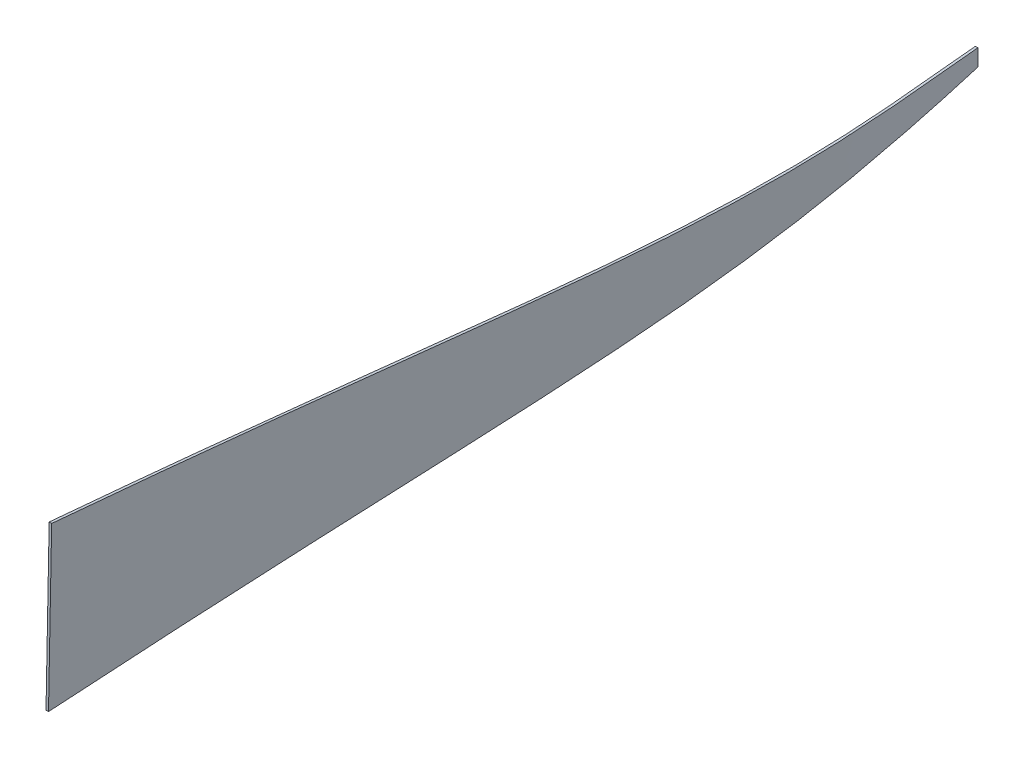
ISO-10303-21;
HEADER;
FILE_DESCRIPTION(('STEP AP214'),'2;1');
FILE_NAME('part.step','',(''),(''),'','','');
FILE_SCHEMA(('AUTOMOTIVE_DESIGN { 1 0 10303 214 1 1 1 1 }'));
ENDSEC;
DATA;
#1=APPLICATION_CONTEXT('core data for automotive mechanical design processes');
#2=APPLICATION_PROTOCOL_DEFINITION('international standard','automotive_design',2000,#1);
#3=PRODUCT_CONTEXT('',#1,'mechanical');
#4=PRODUCT('Part','Part','',(#3));
#5=PRODUCT_RELATED_PRODUCT_CATEGORY('part','',(#4));
#6=PRODUCT_DEFINITION_FORMATION('','',#4);
#7=PRODUCT_DEFINITION_CONTEXT('part definition',#1,'design');
#8=PRODUCT_DEFINITION('design','',#6,#7);
#9=PRODUCT_DEFINITION_SHAPE('','',#8);
#10=(LENGTH_UNIT() NAMED_UNIT(*) SI_UNIT(.MILLI.,.METRE.));
#11=(NAMED_UNIT(*) PLANE_ANGLE_UNIT() SI_UNIT($,.RADIAN.));
#12=(NAMED_UNIT(*) SI_UNIT($,.STERADIAN.) SOLID_ANGLE_UNIT());
#13=UNCERTAINTY_MEASURE_WITH_UNIT(LENGTH_MEASURE(1.E-05),#10,'distance_accuracy_value','');
#14=(GEOMETRIC_REPRESENTATION_CONTEXT(3) GLOBAL_UNCERTAINTY_ASSIGNED_CONTEXT((#13)) GLOBAL_UNIT_ASSIGNED_CONTEXT((#10,
#11,#12)) REPRESENTATION_CONTEXT('',''));
#15=CARTESIAN_POINT('',(0.,0.,0.));
#16=DIRECTION('',(0.,0.,1.));
#17=DIRECTION('',(1.,0.,0.));
#18=AXIS2_PLACEMENT_3D('',#15,#16,#17);
#19=CARTESIAN_POINT('',(76.7293236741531,18.2593360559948,-413.034724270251));
#20=CARTESIAN_POINT('',(77.1879954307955,17.6541807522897,-409.03673791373));
#21=CARTESIAN_POINT('',(77.6301911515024,17.0634474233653,-405.037190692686));
#22=CARTESIAN_POINT('',(78.4768181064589,15.9197203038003,-397.034417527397));
#23=CARTESIAN_POINT('',(78.8812297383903,15.3665096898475,-393.031223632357));
#24=CARTESIAN_POINT('',(79.6472051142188,14.3019232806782,-385.021383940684));
#25=CARTESIAN_POINT('',(80.0087678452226,13.7905062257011,-381.014745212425));
#26=CARTESIAN_POINT('',(80.515186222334,13.0572565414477,-375.002481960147));
#27=CARTESIAN_POINT('',(80.6780047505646,12.8184810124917,-372.998010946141));
#28=CARTESIAN_POINT('',(80.9910351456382,12.3525963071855,-368.988356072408));
#29=CARTESIAN_POINT('',(81.141322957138,12.1253852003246,-366.982396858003));
#30=CARTESIAN_POINT('',(81.8589089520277,11.0204310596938,-356.95867796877));
#31=CARTESIAN_POINT('',(82.327611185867,10.2315612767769,-348.92620513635));
#32=CARTESIAN_POINT('',(83.0717037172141,8.83983874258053,-332.892194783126));
#33=CARTESIAN_POINT('',(83.3478727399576,8.23572004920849,-324.875787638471));
#34=CARTESIAN_POINT('',(83.7638399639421,7.16413239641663,-308.85098650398));
#35=CARTESIAN_POINT('',(83.9036379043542,6.69665622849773,-300.842593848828));
#36=CARTESIAN_POINT('',(84.1022074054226,5.8512846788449,-284.840676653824));
#37=CARTESIAN_POINT('',(84.1610279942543,5.47317253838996,-276.842353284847));
#38=CARTESIAN_POINT('',(84.2392183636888,4.75322058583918,-260.850359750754));
#39=CARTESIAN_POINT('',(84.2586140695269,4.41136727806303,-252.856362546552));
#40=CARTESIAN_POINT('',(84.272964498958,3.90067382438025,-240.865985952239));
#41=CARTESIAN_POINT('',(84.2752907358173,3.73079038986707,-236.869297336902));
#42=CARTESIAN_POINT('',(84.2769446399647,3.47334932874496,-230.874123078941));
#43=CARTESIAN_POINT('',(84.2771900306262,3.38709965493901,-228.8757081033));
#44=CARTESIAN_POINT('',(84.2773305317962,3.25667896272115,-225.878013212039));
#45=CARTESIAN_POINT('',(84.2773394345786,3.21303103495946,-224.878769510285));
#46=CARTESIAN_POINT('',(84.2773248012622,3.14724857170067,-223.37988121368));
#47=CARTESIAN_POINT('',(84.2773152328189,3.12522775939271,-222.879310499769));
#48=CARTESIAN_POINT('',(84.2772917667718,3.08136442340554,-221.884701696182));
#49=CARTESIAN_POINT('',(84.2772778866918,3.05954982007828,-221.391293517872));
#50=CARTESIAN_POINT('',(84.2772627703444,3.0354607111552,-220.847927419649));
#51=CARTESIAN_POINT('',(84.2772620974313,3.03438733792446,-220.823720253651));
#52=CARTESIAN_POINT('',(84.2772604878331,3.03181676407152,-220.765754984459));
#53=CARTESIAN_POINT('',(84.2772596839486,3.030531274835,-220.736772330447));
#54=CARTESIAN_POINT('',(84.2772572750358,3.02667419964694,-220.64982431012));
#55=CARTESIAN_POINT('',(84.2772556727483,3.02410200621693,-220.59185888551));
#56=CARTESIAN_POINT('',(84.2772508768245,3.01638299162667,-220.417962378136));
#57=CARTESIAN_POINT('',(84.2772476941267,3.01123373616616,-220.302031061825));
#58=CARTESIAN_POINT('',(84.2772381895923,2.99577619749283,-219.954236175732));
#59=CARTESIAN_POINT('',(84.2772319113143,2.98545814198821,-219.722371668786));
#60=CARTESIAN_POINT('',(84.2772132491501,2.95446460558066,-219.026774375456));
#61=CARTESIAN_POINT('',(84.2772010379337,2.93374975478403,-218.563037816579));
#62=CARTESIAN_POINT('',(84.2771650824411,2.87144547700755,-217.171812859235));
#63=CARTESIAN_POINT('',(84.2771420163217,2.82969632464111,-216.244309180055));
#64=CARTESIAN_POINT('',(84.2770754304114,2.70379199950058,-213.461735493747));
#65=CARTESIAN_POINT('',(84.2770345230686,2.61897995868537,-211.606602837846));
#66=CARTESIAN_POINT('',(84.276921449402,2.36177263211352,-206.040942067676));
#67=CARTESIAN_POINT('',(84.2768589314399,2.18660614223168,-202.330151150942));
#68=CARTESIAN_POINT('',(84.2767035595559,1.64887200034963,-191.196629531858));
#69=CARTESIAN_POINT('',(84.2766428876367,1.27406967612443,-183.772749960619));
#70=CARTESIAN_POINT('',(84.2765383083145,0.0915251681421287,-161.495734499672));
#71=CARTESIAN_POINT('',(84.2765718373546,-0.774354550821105,-146.63722186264));
#72=CARTESIAN_POINT('',(84.2765718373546,-1.74228124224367,-131.769456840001));
#73=CARTESIAN_POINT('',(75.9975238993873,18.2593360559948,-412.950768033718));
#74=CARTESIAN_POINT('',(76.4558758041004,17.6489505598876,-408.955569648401));
#75=CARTESIAN_POINT('',(76.8978501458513,17.0570643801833,-404.958317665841));
#76=CARTESIAN_POINT('',(77.7439969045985,15.9128657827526,-396.960180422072));
#77=CARTESIAN_POINT('',(78.1481693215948,15.3605533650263,-392.959295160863));
#78=CARTESIAN_POINT('',(78.9136654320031,14.2980774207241,-384.954365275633));
#79=CARTESIAN_POINT('',(79.274989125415,13.7879138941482,-380.950320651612));
#80=CARTESIAN_POINT('',(79.7810530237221,13.0562116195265,-374.94223963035));
#81=CARTESIAN_POINT('',(79.9437540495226,12.8179013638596,-372.939210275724));
#82=CARTESIAN_POINT('',(80.2565513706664,12.352783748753,-368.932539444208));
#83=CARTESIAN_POINT('',(80.4067231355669,12.1258733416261,-366.928128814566));
#84=CARTESIAN_POINT('',(81.1237383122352,11.0219137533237,-356.912385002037));
#85=CARTESIAN_POINT('',(81.592078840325,10.2323683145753,-348.886132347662));
#86=CARTESIAN_POINT('',(82.335624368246,8.84006224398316,-332.863884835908));
#87=CARTESIAN_POINT('',(82.6116293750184,8.23588951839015,-324.85249294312));
#88=CARTESIAN_POINT('',(83.0273799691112,7.16427145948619,-308.836032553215));
#89=CARTESIAN_POINT('',(83.1671255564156,6.69682612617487,-300.830964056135));
#90=CARTESIAN_POINT('',(83.3656334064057,5.85142962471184,-284.834010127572));
#91=CARTESIAN_POINT('',(83.4244427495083,5.47326637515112,-276.83753678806));
#92=CARTESIAN_POINT('',(83.5026212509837,4.75325535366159,-260.847967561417));
#93=CARTESIAN_POINT('',(83.5220153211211,4.41138549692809,-252.854876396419));
#94=CARTESIAN_POINT('',(83.5363646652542,3.90067812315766,-240.865406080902));
#95=CARTESIAN_POINT('',(83.538690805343,3.73079191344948,-236.868943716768));
#96=CARTESIAN_POINT('',(83.5403446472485,3.47334874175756,-230.873995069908));
#97=CARTESIAN_POINT('',(83.5405900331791,3.38709870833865,-228.875636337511));
#98=CARTESIAN_POINT('',(83.5407305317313,3.25667791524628,-225.877997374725));
#99=CARTESIAN_POINT('',(83.5407394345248,3.21303002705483,-224.878767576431));
#100=CARTESIAN_POINT('',(83.5407248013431,3.14724772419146,-223.379893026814));
#101=CARTESIAN_POINT('',(83.5407152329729,3.12522698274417,-222.879325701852));
#102=CARTESIAN_POINT('',(83.5406917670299,3.08136381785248,-221.884721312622));
#103=CARTESIAN_POINT('',(83.5406778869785,3.05954931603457,-221.391314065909));
#104=CARTESIAN_POINT('',(83.5406627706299,3.03546032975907,-220.847947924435));
#105=CARTESIAN_POINT('',(83.5406620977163,3.0343869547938,-220.823740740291));
#106=CARTESIAN_POINT('',(83.5406604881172,3.03181638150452,-220.765775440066));
#107=CARTESIAN_POINT('',(83.5406596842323,3.03053089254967,-220.736792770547));
#108=CARTESIAN_POINT('',(83.5406572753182,3.02667381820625,-220.649844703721));
#109=CARTESIAN_POINT('',(83.5406556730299,3.02410162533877,-220.591879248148));
#110=CARTESIAN_POINT('',(83.5406508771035,3.01638261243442,-220.417982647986));
#111=CARTESIAN_POINT('',(83.540647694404,3.01123335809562,-220.302051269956));
#112=CARTESIAN_POINT('',(83.5406381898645,2.9957758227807,-219.954256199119));
#113=CARTESIAN_POINT('',(83.5406319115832,2.98545776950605,-219.722391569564));
#114=CARTESIAN_POINT('',(83.5406132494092,2.95446423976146,-219.026793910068));
#115=CARTESIAN_POINT('',(83.5406010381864,2.93374939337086,-218.563057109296));
#116=CARTESIAN_POINT('',(83.5405650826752,2.87144512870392,-217.171831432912));
#117=CARTESIAN_POINT('',(83.540542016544,2.82969598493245,-216.244327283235));
#118=CARTESIAN_POINT('',(83.5404754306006,2.70379168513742,-213.461752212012));
#119=CARTESIAN_POINT('',(83.5404345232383,2.61897966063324,-211.606618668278));
#120=CARTESIAN_POINT('',(83.5403214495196,2.36177238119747,-206.040955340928));
#121=CARTESIAN_POINT('',(83.5402589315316,2.18660592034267,-202.330162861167));
#122=CARTESIAN_POINT('',(83.540103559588,1.64887185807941,-191.196636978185));
#123=CARTESIAN_POINT('',(83.5400428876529,1.27406957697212,-183.77275513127));
#124=CARTESIAN_POINT('',(83.5399383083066,0.091525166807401,-161.495734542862));
#125=CARTESIAN_POINT('',(83.5399718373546,-0.774354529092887,-146.637220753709));
#126=CARTESIAN_POINT('',(83.5399718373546,-1.74228124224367,-131.769456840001));
#127=B_SPLINE_SURFACE_WITH_KNOTS('',1,3,((#19,#20,#21,#22,#23,#24,#25,#26,#27,#28,#29,#30,#31,
#32,#33,#34,#35,#36,#37,#38,#39,#40,#41,#42,#43,#44,#45,#46,#47,#48,#49,#50,#51,#52,#53,#54,#55,
#56,#57,#58,#59,#60,#61,#62,#63,#64,#65,#66,#67,#68,#69,#70,#71,#72),(#73,#74,#75,#76,#77,#78,
#79,#80,#81,#82,#83,#84,#85,#86,#87,#88,#89,#90,#91,#92,#93,#94,#95,#96,#97,#98,#99,#100,#101,
#102,#103,#104,#105,#106,#107,#108,#109,#110,#111,#112,#113,#114,#115,#116,#117,#118,#119,#120,
#121,#122,#123,#124,#125,#126)),.UNSPECIFIED.,.F.,.F.,.F.,(2,2),(4,2,2,2,2,2,2,2,2,2,2,2,2,2,2,
2,2,2,2,2,2,2,2,2,2,2,4),(0.,1.),(0.,0.03125,0.0625,0.09375,0.109375,0.125,0.1875,0.25,0.3125,
0.375,0.4375,0.46875,0.484375,0.4921875,0.49609375,0.5,0.50048828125,0.5009765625,0.501953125,
0.50390625,0.5078125,0.515625,0.53125,0.5625,0.625,0.75,1.),.UNSPECIFIED.);
#128=CARTESIAN_POINT('',(84.2765718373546,-1.74228124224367,-131.769456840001));
#129=CARTESIAN_POINT('',(83.5399718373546,-1.74228124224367,-131.769456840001));
#130=B_SPLINE_CURVE_WITH_KNOTS('',1,(#128,#129),.UNSPECIFIED.,.F.,.F.,(2,2),(0.,1.),.UNSPECIFIED.);
#131=CARTESIAN_POINT('',(83.5399718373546,-1.74228124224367,-131.769456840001));
#132=VERTEX_POINT('',#131);
#133=CARTESIAN_POINT('',(84.2765718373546,-1.74228124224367,-131.769456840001));
#134=VERTEX_POINT('',#133);
#135=EDGE_CURVE('E15',#132,#134,#130,.F.);
#136=CARTESIAN_POINT('',(83.5399718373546,-1.74228124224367,-131.769456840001));
#137=CARTESIAN_POINT('',(83.5399718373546,-0.774354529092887,-146.637220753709));
#138=CARTESIAN_POINT('',(83.5399383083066,0.091525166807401,-161.495734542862));
#139=CARTESIAN_POINT('',(83.5400428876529,1.27406957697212,-183.77275513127));
#140=CARTESIAN_POINT('',(83.540103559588,1.64887185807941,-191.196636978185));
#141=CARTESIAN_POINT('',(83.5402589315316,2.18660592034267,-202.330162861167));
#142=CARTESIAN_POINT('',(83.5403214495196,2.36177238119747,-206.040955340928));
#143=CARTESIAN_POINT('',(83.5404345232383,2.61897966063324,-211.606618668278));
#144=CARTESIAN_POINT('',(83.5404754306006,2.70379168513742,-213.461752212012));
#145=CARTESIAN_POINT('',(83.540542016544,2.82969598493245,-216.244327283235));
#146=CARTESIAN_POINT('',(83.5405650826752,2.87144512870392,-217.171831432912));
#147=CARTESIAN_POINT('',(83.5406010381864,2.93374939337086,-218.563057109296));
#148=CARTESIAN_POINT('',(83.5406132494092,2.95446423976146,-219.026793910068));
#149=CARTESIAN_POINT('',(83.5406319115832,2.98545776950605,-219.722391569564));
#150=CARTESIAN_POINT('',(83.5406381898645,2.9957758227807,-219.954256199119));
#151=CARTESIAN_POINT('',(83.540647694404,3.01123335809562,-220.302051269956));
#152=CARTESIAN_POINT('',(83.5406508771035,3.01638261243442,-220.417982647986));
#153=CARTESIAN_POINT('',(83.5406556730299,3.02410162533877,-220.591879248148));
#154=CARTESIAN_POINT('',(83.5406572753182,3.02667381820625,-220.649844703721));
#155=CARTESIAN_POINT('',(83.5406596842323,3.03053089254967,-220.736792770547));
#156=CARTESIAN_POINT('',(83.5406604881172,3.03181638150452,-220.765775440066));
#157=CARTESIAN_POINT('',(83.5406620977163,3.0343869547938,-220.823740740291));
#158=CARTESIAN_POINT('',(83.5406627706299,3.03546032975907,-220.847947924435));
#159=CARTESIAN_POINT('',(83.5406778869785,3.05954931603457,-221.391314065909));
#160=CARTESIAN_POINT('',(83.5406917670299,3.08136381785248,-221.884721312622));
#161=CARTESIAN_POINT('',(83.5407152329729,3.12522698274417,-222.879325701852));
#162=CARTESIAN_POINT('',(83.5407248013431,3.14724772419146,-223.379893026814));
#163=CARTESIAN_POINT('',(83.5407394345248,3.21303002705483,-224.878767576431));
#164=CARTESIAN_POINT('',(83.5407305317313,3.25667791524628,-225.877997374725));
#165=CARTESIAN_POINT('',(83.5405900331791,3.38709870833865,-228.875636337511));
#166=CARTESIAN_POINT('',(83.5403446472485,3.47334874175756,-230.873995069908));
#167=CARTESIAN_POINT('',(83.538690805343,3.73079191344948,-236.868943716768));
#168=CARTESIAN_POINT('',(83.5363646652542,3.90067812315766,-240.865406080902));
#169=CARTESIAN_POINT('',(83.5220153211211,4.41138549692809,-252.854876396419));
#170=CARTESIAN_POINT('',(83.5026212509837,4.75325535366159,-260.847967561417));
#171=CARTESIAN_POINT('',(83.4244427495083,5.47326637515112,-276.83753678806));
#172=CARTESIAN_POINT('',(83.3656334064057,5.85142962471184,-284.834010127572));
#173=CARTESIAN_POINT('',(83.1671255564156,6.69682612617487,-300.830964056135));
#174=CARTESIAN_POINT('',(83.0273799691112,7.16427145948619,-308.836032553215));
#175=CARTESIAN_POINT('',(82.6116293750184,8.23588951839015,-324.85249294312));
#176=CARTESIAN_POINT('',(82.335624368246,8.84006224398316,-332.863884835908));
#177=CARTESIAN_POINT('',(81.592078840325,10.2323683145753,-348.886132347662));
#178=CARTESIAN_POINT('',(81.1237383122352,11.0219137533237,-356.912385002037));
#179=CARTESIAN_POINT('',(80.4067231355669,12.1258733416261,-366.928128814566));
#180=CARTESIAN_POINT('',(80.2565513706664,12.352783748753,-368.932539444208));
#181=CARTESIAN_POINT('',(79.9437540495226,12.8179013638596,-372.939210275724));
#182=CARTESIAN_POINT('',(79.7810530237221,13.0562116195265,-374.94223963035));
#183=CARTESIAN_POINT('',(79.274989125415,13.7879138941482,-380.950320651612));
#184=CARTESIAN_POINT('',(78.9136654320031,14.2980774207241,-384.954365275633));
#185=CARTESIAN_POINT('',(78.1481693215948,15.3605533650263,-392.959295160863));
#186=CARTESIAN_POINT('',(77.7439969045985,15.9128657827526,-396.960180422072));
#187=CARTESIAN_POINT('',(76.8978501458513,17.0570643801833,-404.958317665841));
#188=CARTESIAN_POINT('',(76.4558758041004,17.6489505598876,-408.955569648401));
#189=CARTESIAN_POINT('',(75.9975238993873,18.2593360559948,-412.950768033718));
#190=B_SPLINE_CURVE_WITH_KNOTS('',3,(#136,#137,#138,#139,#140,#141,#142,#143,#144,#145,#146,
#147,#148,#149,#150,#151,#152,#153,#154,#155,#156,#157,#158,#159,#160,#161,#162,#163,#164,#165,
#166,#167,#168,#169,#170,#171,#172,#173,#174,#175,#176,#177,#178,#179,#180,#181,#182,#183,#184,
#185,#186,#187,#188,#189),.UNSPECIFIED.,.F.,.F.,(4,2,2,2,2,2,2,2,2,2,2,2,2,2,2,2,2,2,2,2,2,2,2,
2,2,2,4),(0.,0.25,0.375,0.4375,0.46875,0.484375,0.4921875,0.49609375,0.498046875,0.4990234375,
0.49951171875,0.5,0.50390625,0.5078125,0.515625,0.53125,0.5625,0.625,0.6875,0.75,0.8125,0.875,
0.890625,0.90625,0.9375,0.96875,1.),.UNSPECIFIED.);
#191=CARTESIAN_POINT('',(75.9975238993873,18.2593360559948,-412.950768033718));
#192=VERTEX_POINT('',#191);
#193=EDGE_CURVE('E134',#132,#192,#190,.T.);
#194=CARTESIAN_POINT('',(75.9975238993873,18.2593360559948,-412.950768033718));
#195=CARTESIAN_POINT('',(76.7293236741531,18.2593360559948,-413.034724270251));
#196=B_SPLINE_CURVE_WITH_KNOTS('',1,(#194,#195),.UNSPECIFIED.,.F.,.F.,(2,2),(0.,1.),.UNSPECIFIED.);
#197=CARTESIAN_POINT('',(76.7293236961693,18.2593360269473,-413.034724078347));
#198=VERTEX_POINT('',#197);
#199=EDGE_CURVE('E83',#192,#198,#196,.T.);
#200=CARTESIAN_POINT('',(84.2765718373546,-1.74228124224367,-131.769456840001));
#201=CARTESIAN_POINT('',(84.2765710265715,-1.258549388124,-139.199607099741));
#202=CARTESIAN_POINT('',(84.2765630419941,-0.800071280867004,-146.631361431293));
#203=CARTESIAN_POINT('',(84.2765645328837,0.0719564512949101,-161.490766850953));
#204=CARTESIAN_POINT('',(84.2765739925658,0.485546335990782,-168.918415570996));
#205=CARTESIAN_POINT('',(84.2766420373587,1.27393107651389,-183.770109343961));
#206=CARTESIAN_POINT('',(84.2767005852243,1.64875510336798,-191.194152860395));
#207=CARTESIAN_POINT('',(84.2769137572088,2.36617240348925,-206.048038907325));
#208=CARTESIAN_POINT('',(84.2770684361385,2.70874716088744,-213.477882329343));
#209=CARTESIAN_POINT('',(84.2774750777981,3.39208549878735,-228.892704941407));
#210=CARTESIAN_POINT('',(84.2777334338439,3.73080979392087,-236.877773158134));
#211=CARTESIAN_POINT('',(84.2586168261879,4.41141973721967,-252.857634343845));
#212=CARTESIAN_POINT('',(84.2392176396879,4.7533087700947,-260.852427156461));
#213=CARTESIAN_POINT('',(84.1609996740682,5.47335172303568,-276.846224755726));
#214=CARTESIAN_POINT('',(84.1021516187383,5.85153239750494,-284.845228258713));
#215=CARTESIAN_POINT('',(83.9035117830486,6.6971829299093,-300.852701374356));
#216=CARTESIAN_POINT('',(83.7635718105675,7.16481520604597,-308.861161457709));
#217=CARTESIAN_POINT('',(83.4517981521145,7.9679981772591,-320.872222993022));
#218=CARTESIAN_POINT('',(83.3307306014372,8.25300501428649,-324.879494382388));
#219=CARTESIAN_POINT('',(83.0476307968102,8.86299335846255,-332.895266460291));
#220=CARTESIAN_POINT('',(82.8855412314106,9.18803046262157,-336.903760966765));
#221=CARTESIAN_POINT('',(82.513355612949,9.88415147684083,-344.923647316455));
#222=CARTESIAN_POINT('',(82.3031524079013,10.2553373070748,-348.935025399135));
#223=CARTESIAN_POINT('',(81.8323943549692,11.0445222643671,-356.958329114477));
#224=CARTESIAN_POINT('',(81.5717400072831,11.4626132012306,-360.970239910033));
#225=CARTESIAN_POINT('',(80.9974531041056,12.3469248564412,-368.99187145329));
#226=CARTESIAN_POINT('',(80.6837314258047,12.8132260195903,-373.001576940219));
#227=CARTESIAN_POINT('',(80.0084964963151,13.7908908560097,-381.017881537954));
#228=CARTESIAN_POINT('',(79.6469086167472,14.3023244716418,-385.024465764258));
#229=CARTESIAN_POINT('',(78.880948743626,15.3669111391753,-393.034180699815));
#230=CARTESIAN_POINT('',(78.4765130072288,15.92012598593,-397.037297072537));
#231=CARTESIAN_POINT('',(77.8417756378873,16.777616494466,-403.037182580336));
#232=CARTESIAN_POINT('',(77.6253935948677,17.068219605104,-405.037406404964));
#233=CARTESIAN_POINT('',(77.1837988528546,17.6577888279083,-409.036998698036));
#234=CARTESIAN_POINT('',(76.9585804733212,17.9567602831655,-411.036365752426));
#235=CARTESIAN_POINT('',(76.7293236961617,18.2593360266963,-413.034724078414));
#236=B_SPLINE_CURVE_WITH_KNOTS('',3,(#200,#201,#202,#203,#204,#205,#206,#207,#208,#209,#210,
#211,#212,#213,#214,#215,#216,#217,#218,#219,#220,#221,#222,#223,#224,#225,#226,#227,#228,#229,
#230,#231,#232,#233,#234,#235),.UNSPECIFIED.,.F.,.F.,(4,2,2,2,2,2,2,2,2,2,2,2,2,2,2,2,2,4),(0.,
22.3375395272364,44.6548762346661,66.9552952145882,89.2684408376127,113.245172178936,
137.251484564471,161.275632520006,185.343822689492,197.4011471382,209.475410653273,
221.576830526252,233.702364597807,245.848468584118,258.013737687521,270.197365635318,
276.295655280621,282.397931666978),.UNSPECIFIED.);
#237=EDGE_CURVE('E296',#134,#198,#236,.T.);
#238=ORIENTED_EDGE('',*,*,#135,.F.);
#239=ORIENTED_EDGE('',*,*,#193,.T.);
#240=ORIENTED_EDGE('',*,*,#199,.T.);
#241=ORIENTED_EDGE('',*,*,#237,.F.);
#242=EDGE_LOOP('',(#238,#239,#240,#241));
#243=FACE_BOUND('',#242,.T.);
#244=ADVANCED_FACE('F71',(#243),#127,.F.);
#245=CARTESIAN_POINT('',(76.7293236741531,18.2593360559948,-413.034724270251));
#246=CARTESIAN_POINT('',(76.7295668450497,19.8998802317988,-413.03260468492));
#247=CARTESIAN_POINT('',(76.7298015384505,21.5404244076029,-413.030477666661));
#248=CARTESIAN_POINT('',(76.7300275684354,23.1809685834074,-413.028343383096));
#249=CARTESIAN_POINT('',(75.9975238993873,18.2593360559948,-412.950768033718));
#250=CARTESIAN_POINT('',(75.9975238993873,19.899880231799,-412.950768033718));
#251=CARTESIAN_POINT('',(75.9975238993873,21.5404244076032,-412.950768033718));
#252=CARTESIAN_POINT('',(75.9975238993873,23.1809685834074,-412.950768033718));
#253=B_SPLINE_SURFACE_WITH_KNOTS('',1,3,((#245,#246,#247,#248),(#249,#250,#251,#252)),
.UNSPECIFIED.,.F.,.F.,.F.,(2,2),(4,4),(0.,1.),(-0.00246081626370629,0.00246081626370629),.UNSPECIFIED.);
#254=CARTESIAN_POINT('',(75.9975238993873,18.2593360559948,-412.950768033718));
#255=CARTESIAN_POINT('',(75.9975238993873,19.899880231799,-412.950768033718));
#256=CARTESIAN_POINT('',(75.9975238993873,21.5404244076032,-412.950768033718));
#257=CARTESIAN_POINT('',(75.9975238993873,23.1809685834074,-412.950768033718));
#258=B_SPLINE_CURVE_WITH_KNOTS('',3,(#254,#255,#256,#257),.UNSPECIFIED.,.F.,.F.,(4,4),
(-0.00246081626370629,0.00246081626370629),.UNSPECIFIED.);
#259=CARTESIAN_POINT('',(75.9975238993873,23.1809685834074,-412.950768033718));
#260=VERTEX_POINT('',#259);
#261=EDGE_CURVE('E294',#192,#260,#258,.T.);
#262=CARTESIAN_POINT('',(75.9975238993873,23.1809685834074,-412.950768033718));
#263=CARTESIAN_POINT('',(76.7300275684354,23.1809685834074,-413.028343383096));
#264=B_SPLINE_CURVE_WITH_KNOTS('',1,(#262,#263),.UNSPECIFIED.,.F.,.F.,(2,2),(0.,1.),.UNSPECIFIED.);
#265=CARTESIAN_POINT('',(76.7300275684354,23.1809685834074,-413.028343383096));
#266=VERTEX_POINT('',#265);
#267=EDGE_CURVE('E123',#260,#266,#264,.T.);
#268=CARTESIAN_POINT('',(76.7293236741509,18.2593360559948,-413.03472427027));
#269=CARTESIAN_POINT('',(76.7293540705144,18.4644040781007,-413.034459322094));
#270=CARTESIAN_POINT('',(76.7293843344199,18.6694721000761,-413.034194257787));
#271=CARTESIAN_POINT('',(76.7294445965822,19.0796081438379,-413.033663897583));
#272=CARTESIAN_POINT('',(76.7294745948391,19.2846761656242,-413.033398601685));
#273=CARTESIAN_POINT('',(76.7295343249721,19.6948122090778,-413.03286777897));
#274=CARTESIAN_POINT('',(76.7295640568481,19.8998802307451,-413.032602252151));
#275=CARTESIAN_POINT('',(76.7296232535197,20.3100162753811,-413.032070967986));
#276=CARTESIAN_POINT('',(76.7296527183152,20.5150842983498,-413.03180521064));
#277=CARTESIAN_POINT('',(76.7297113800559,20.9252203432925,-413.031273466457));
#278=CARTESIAN_POINT('',(76.7297405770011,21.1302883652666,-413.031007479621));
#279=CARTESIAN_POINT('',(76.729798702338,21.5404244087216,-413.030475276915));
#280=CARTESIAN_POINT('',(76.7298276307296,21.7454924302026,-413.030209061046));
#281=CARTESIAN_POINT('',(76.7298852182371,22.1556284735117,-413.029676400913));
#282=CARTESIAN_POINT('',(76.7299138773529,22.3606964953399,-413.029409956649));
#283=CARTESIAN_POINT('',(76.7299709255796,22.7708325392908,-413.02887684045));
#284=CARTESIAN_POINT('',(76.7299993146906,22.9759005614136,-413.028610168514));
#285=CARTESIAN_POINT('',(76.7300275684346,23.1809685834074,-413.028343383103));
#286=B_SPLINE_CURVE_WITH_KNOTS('',3,(#268,#269,#270,#271,#272,#273,#274,#275,#276,#277,#278,
#279,#280,#281,#282,#283,#284,#285),.UNSPECIFIED.,.F.,.F.,(4,2,2,2,2,2,2,2,4),(0.,
0.615204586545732,1.23040917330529,1.84561376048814,2.46081835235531,3.07602294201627,
3.69122753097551,4.30643212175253,4.9216367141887),.UNSPECIFIED.);
#287=EDGE_CURVE('E144',#198,#266,#286,.T.);
#288=ORIENTED_EDGE('',*,*,#199,.F.);
#289=ORIENTED_EDGE('',*,*,#261,.T.);
#290=ORIENTED_EDGE('',*,*,#267,.T.);
#291=ORIENTED_EDGE('',*,*,#287,.F.);
#292=EDGE_LOOP('',(#288,#289,#290,#291));
#293=FACE_BOUND('',#292,.T.);
#294=ADVANCED_FACE('F168',(#293),#253,.T.);
#295=CARTESIAN_POINT('',(76.7300275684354,23.1809685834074,-413.028343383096));
#296=CARTESIAN_POINT('',(77.1522806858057,23.2230283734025,-409.041226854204));
#297=CARTESIAN_POINT('',(77.5745619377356,23.2609892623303,-405.053586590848));
#298=CARTESIAN_POINT('',(78.4032111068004,23.3501035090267,-397.07648408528));
#299=CARTESIAN_POINT('',(78.8095645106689,23.4010382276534,-393.087016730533));
#300=CARTESIAN_POINT('',(79.9805519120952,23.5984607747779,-381.114596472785));
#301=CARTESIAN_POINT('',(80.6971150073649,23.78962305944,-373.127608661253));
#302=CARTESIAN_POINT('',(81.8732542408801,24.4161981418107,-357.13628192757));
#303=CARTESIAN_POINT('',(82.3326000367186,24.8511653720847,-349.135086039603));
#304=CARTESIAN_POINT('',(83.0677056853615,25.894464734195,-333.139322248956));
#305=CARTESIAN_POINT('',(83.3434812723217,26.5029573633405,-325.144369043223));
#306=CARTESIAN_POINT('',(83.7613095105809,27.8542729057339,-309.163171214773));
#307=CARTESIAN_POINT('',(83.9033621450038,28.597088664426,-301.176926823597));
#308=CARTESIAN_POINT('',(84.1035490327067,30.1774620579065,-285.21599588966));
#309=CARTESIAN_POINT('',(84.161684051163,31.0150128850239,-277.241235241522));
#310=CARTESIAN_POINT('',(84.2391029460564,32.7151412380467,-261.29551041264));
#311=CARTESIAN_POINT('',(84.2583879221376,33.5777283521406,-253.324152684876));
#312=CARTESIAN_POINT('',(84.272748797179,34.881000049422,-241.36846902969));
#313=CARTESIAN_POINT('',(84.2751079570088,35.3169890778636,-237.383466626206));
#314=CARTESIAN_POINT('',(84.2768259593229,35.9721458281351,-231.4061881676));
#315=CARTESIAN_POINT('',(84.2770951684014,36.1907269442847,-229.413799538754));
#316=CARTESIAN_POINT('',(84.2772713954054,36.5187450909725,-226.425258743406));
#317=CARTESIAN_POINT('',(84.2772922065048,36.6281088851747,-225.429085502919));
#318=CARTESIAN_POINT('',(84.2772949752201,36.7921728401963,-223.934834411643));
#319=CARTESIAN_POINT('',(84.2772911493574,36.8469683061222,-223.435816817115));
#320=CARTESIAN_POINT('',(84.277278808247,36.9558336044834,-222.444310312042));
#321=CARTESIAN_POINT('',(84.2772702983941,37.009832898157,-221.952472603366));
#322=CARTESIAN_POINT('',(84.2772608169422,37.0692769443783,-221.410801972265));
#323=CARTESIAN_POINT('',(84.277260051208,37.0718526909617,-221.386699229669));
#324=CARTESIAN_POINT('',(84.2772584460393,37.0780675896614,-221.328973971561));
#325=CARTESIAN_POINT('',(84.2772576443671,37.0811748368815,-221.30011132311));
#326=CARTESIAN_POINT('',(84.2772552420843,37.0904959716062,-221.213523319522));
#327=CARTESIAN_POINT('',(84.2772536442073,37.0967092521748,-221.155797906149));
#328=CARTESIAN_POINT('',(84.2772488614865,37.1153466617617,-220.982621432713));
#329=CARTESIAN_POINT('',(84.2772456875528,37.127768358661,-220.867170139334));
#330=CARTESIAN_POINT('',(84.2772362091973,37.1650236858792,-220.52081532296));
#331=CARTESIAN_POINT('',(84.277229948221,37.1898475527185,-220.289910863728));
#332=CARTESIAN_POINT('',(84.2772113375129,37.2642798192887,-219.597193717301));
#333=CARTESIAN_POINT('',(84.2771991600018,37.3138488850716,-219.135377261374));
#334=CARTESIAN_POINT('',(84.27716330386,37.4623965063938,-217.749912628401));
#335=CARTESIAN_POINT('',(84.277140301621,37.5612154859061,-216.826249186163));
#336=CARTESIAN_POINT('',(84.2770739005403,37.8570161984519,-214.055196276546));
#337=CARTESIAN_POINT('',(84.2770331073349,38.0533417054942,-212.207744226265));
#338=CARTESIAN_POINT('',(84.276920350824,38.6395499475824,-206.665125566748));
#339=CARTESIAN_POINT('',(84.2768580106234,39.0266644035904,-202.969696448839));
#340=CARTESIAN_POINT('',(84.2767030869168,40.175787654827,-191.882261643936));
#341=CARTESIAN_POINT('',(84.2766426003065,40.9255763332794,-184.489108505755));
#342=CARTESIAN_POINT('',(84.2765383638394,43.116885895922,-162.304279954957));
#343=CARTESIAN_POINT('',(84.2765718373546,44.5003503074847,-147.507235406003));
#344=CARTESIAN_POINT('',(84.2765718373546,45.7819367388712,-132.700953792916));
#345=CARTESIAN_POINT('',(75.9975238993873,23.1809685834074,-412.950768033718));
#346=CARTESIAN_POINT('',(76.4197819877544,23.217783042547,-408.963604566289));
#347=CARTESIAN_POINT('',(76.8420400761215,23.2545975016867,-404.976441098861));
#348=CARTESIAN_POINT('',(77.670492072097,23.3432536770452,-397.001274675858));
#349=CARTESIAN_POINT('',(78.0766859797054,23.395095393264,-393.013271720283));
#350=CARTESIAN_POINT('',(79.2470751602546,23.5957023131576,-381.046744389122));
#351=CARTESIAN_POINT('',(79.9630778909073,23.789549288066,-373.065701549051));
#352=CARTESIAN_POINT('',(81.1380564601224,24.4176793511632,-357.090184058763));
#353=CARTESIAN_POINT('',(81.5970323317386,24.851962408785,-349.095709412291));
#354=CARTESIAN_POINT('',(82.3316239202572,25.8946864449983,-333.111133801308));
#355=CARTESIAN_POINT('',(82.6072396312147,26.5031274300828,-325.121032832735));
#356=CARTESIAN_POINT('',(83.0248537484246,27.8544147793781,-309.148030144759));
#357=CARTESIAN_POINT('',(83.1668521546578,28.5972611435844,-301.165128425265));
#358=CARTESIAN_POINT('',(83.3669745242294,30.1776066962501,-285.209349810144));
#359=CARTESIAN_POINT('',(83.4250984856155,31.0151058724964,-277.236472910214));
#360=CARTESIAN_POINT('',(83.5025058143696,32.7151757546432,-261.293133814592));
#361=CARTESIAN_POINT('',(83.5217891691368,33.57774648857,-253.322671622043));
#362=CARTESIAN_POINT('',(83.5361489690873,34.8810044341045,-241.367883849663));
#363=CARTESIAN_POINT('',(83.5385080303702,35.3169907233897,-237.383105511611));
#364=CARTESIAN_POINT('',(83.5402259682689,35.9721453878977,-231.406051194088));
#365=CARTESIAN_POINT('',(83.5404951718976,36.1907261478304,-229.41371861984));
#366=CARTESIAN_POINT('',(83.5406713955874,36.518744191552,-226.425233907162));
#367=CARTESIAN_POINT('',(83.5406922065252,36.6281080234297,-225.429074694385));
#368=CARTESIAN_POINT('',(83.5406949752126,36.7921721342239,-223.934837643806));
#369=CARTESIAN_POINT('',(83.5406911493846,36.8469676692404,-223.43582354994));
#370=CARTESIAN_POINT('',(83.5406788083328,36.9558331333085,-222.44432179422));
#371=CARTESIAN_POINT('',(83.5406702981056,37.0098329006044,-221.952462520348));
#372=CARTESIAN_POINT('',(83.5406608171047,37.0692766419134,-221.410817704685));
#373=CARTESIAN_POINT('',(83.5406600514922,37.0718523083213,-221.386719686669));
#374=CARTESIAN_POINT('',(83.5406584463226,37.0780672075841,-221.328994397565));
#375=CARTESIAN_POINT('',(83.54065764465,37.0811744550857,-221.300131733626));
#376=CARTESIAN_POINT('',(83.5406552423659,37.0904955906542,-221.213543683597));
#377=CARTESIAN_POINT('',(83.5406536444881,37.0967088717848,-221.155818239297));
#378=CARTESIAN_POINT('',(83.5406488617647,37.1153462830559,-220.982641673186));
#379=CARTESIAN_POINT('',(83.5406456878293,37.1277679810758,-220.867190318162));
#380=CARTESIAN_POINT('',(83.5406362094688,37.1650233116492,-220.520835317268));
#381=CARTESIAN_POINT('',(83.5406299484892,37.1898471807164,-220.289930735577));
#382=CARTESIAN_POINT('',(83.5406113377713,37.264279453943,-219.59721322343));
#383=CARTESIAN_POINT('',(83.5405991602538,37.3138485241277,-219.135396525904));
#384=CARTESIAN_POINT('',(83.5405633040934,37.4623961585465,-217.749931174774));
#385=CARTESIAN_POINT('',(83.5405403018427,37.5612151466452,-216.826267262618));
#386=CARTESIAN_POINT('',(83.5404739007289,37.8570158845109,-214.055212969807));
#387=CARTESIAN_POINT('',(83.5404331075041,38.0533414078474,-212.207760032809));
#388=CARTESIAN_POINT('',(83.5403203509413,38.6395496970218,-206.665138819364));
#389=CARTESIAN_POINT('',(83.5402580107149,39.0266641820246,-202.969708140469));
#390=CARTESIAN_POINT('',(83.5401030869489,40.1757875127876,-191.882269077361));
#391=CARTESIAN_POINT('',(83.5400426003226,40.9255762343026,-184.489113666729));
#392=CARTESIAN_POINT('',(83.5399383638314,43.1168858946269,-162.30427999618));
#393=CARTESIAN_POINT('',(83.5399718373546,44.5003503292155,-147.507234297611));
#394=CARTESIAN_POINT('',(83.5399718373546,45.7819367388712,-132.700953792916));
#395=B_SPLINE_SURFACE_WITH_KNOTS('',1,3,((#295,#296,#297,#298,#299,#300,#301,#302,#303,#304,
#305,#306,#307,#308,#309,#310,#311,#312,#313,#314,#315,#316,#317,#318,#319,#320,#321,#322,#323,
#324,#325,#326,#327,#328,#329,#330,#331,#332,#333,#334,#335,#336,#337,#338,#339,#340,#341,#342,
#343,#344),(#345,#346,#347,#348,#349,#350,#351,#352,#353,#354,#355,#356,#357,#358,#359,#360,
#361,#362,#363,#364,#365,#366,#367,#368,#369,#370,#371,#372,#373,#374,#375,#376,#377,#378,#379,
#380,#381,#382,#383,#384,#385,#386,#387,#388,#389,#390,#391,#392,#393,#394)),.UNSPECIFIED.,.F.,
.F.,.F.,(2,2),(4,2,2,2,2,2,2,2,2,2,2,2,2,2,2,2,2,2,2,2,2,2,2,2,4),(0.,1.),(0.,0.03125,0.0625,
0.125,0.1875,0.25,0.3125,0.375,0.4375,0.46875,0.484375,0.4921875,0.49609375,0.5,0.50048828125,
0.5009765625,0.501953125,0.50390625,0.5078125,0.515625,0.53125,0.5625,0.625,0.75,1.),.UNSPECIFIED.);
#396=CARTESIAN_POINT('',(75.9975238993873,23.1809685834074,-412.950768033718));
#397=CARTESIAN_POINT('',(76.4197819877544,23.217783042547,-408.963604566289));
#398=CARTESIAN_POINT('',(76.8420400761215,23.2545975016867,-404.976441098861));
#399=CARTESIAN_POINT('',(77.670492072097,23.3432536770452,-397.001274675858));
#400=CARTESIAN_POINT('',(78.0766859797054,23.395095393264,-393.013271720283));
#401=CARTESIAN_POINT('',(79.2470751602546,23.5957023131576,-381.046744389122));
#402=CARTESIAN_POINT('',(79.9630778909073,23.789549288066,-373.065701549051));
#403=CARTESIAN_POINT('',(81.1380564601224,24.4176793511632,-357.090184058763));
#404=CARTESIAN_POINT('',(81.5970323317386,24.851962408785,-349.095709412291));
#405=CARTESIAN_POINT('',(82.3316239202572,25.8946864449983,-333.111133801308));
#406=CARTESIAN_POINT('',(82.6072396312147,26.5031274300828,-325.121032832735));
#407=CARTESIAN_POINT('',(83.0248537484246,27.8544147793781,-309.148030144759));
#408=CARTESIAN_POINT('',(83.1668521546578,28.5972611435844,-301.165128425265));
#409=CARTESIAN_POINT('',(83.3669745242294,30.1776066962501,-285.209349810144));
#410=CARTESIAN_POINT('',(83.4250984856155,31.0151058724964,-277.236472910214));
#411=CARTESIAN_POINT('',(83.5025058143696,32.7151757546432,-261.293133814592));
#412=CARTESIAN_POINT('',(83.5217891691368,33.57774648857,-253.322671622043));
#413=CARTESIAN_POINT('',(83.5361489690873,34.8810044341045,-241.367883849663));
#414=CARTESIAN_POINT('',(83.5385080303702,35.3169907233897,-237.383105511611));
#415=CARTESIAN_POINT('',(83.5402259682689,35.9721453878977,-231.406051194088));
#416=CARTESIAN_POINT('',(83.5404951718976,36.1907261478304,-229.41371861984));
#417=CARTESIAN_POINT('',(83.5406713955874,36.518744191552,-226.425233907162));
#418=CARTESIAN_POINT('',(83.5406922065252,36.6281080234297,-225.429074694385));
#419=CARTESIAN_POINT('',(83.5406949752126,36.7921721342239,-223.934837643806));
#420=CARTESIAN_POINT('',(83.5406911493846,36.8469676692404,-223.43582354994));
#421=CARTESIAN_POINT('',(83.5406788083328,36.9558331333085,-222.44432179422));
#422=CARTESIAN_POINT('',(83.5406702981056,37.0098329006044,-221.952462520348));
#423=CARTESIAN_POINT('',(83.5406608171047,37.0692766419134,-221.410817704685));
#424=CARTESIAN_POINT('',(83.5406600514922,37.0718523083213,-221.386719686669));
#425=CARTESIAN_POINT('',(83.5406584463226,37.0780672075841,-221.328994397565));
#426=CARTESIAN_POINT('',(83.54065764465,37.0811744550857,-221.300131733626));
#427=CARTESIAN_POINT('',(83.5406552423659,37.0904955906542,-221.213543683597));
#428=CARTESIAN_POINT('',(83.5406536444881,37.0967088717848,-221.155818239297));
#429=CARTESIAN_POINT('',(83.5406488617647,37.1153462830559,-220.982641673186));
#430=CARTESIAN_POINT('',(83.5406456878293,37.1277679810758,-220.867190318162));
#431=CARTESIAN_POINT('',(83.5406362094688,37.1650233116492,-220.520835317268));
#432=CARTESIAN_POINT('',(83.5406299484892,37.1898471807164,-220.289930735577));
#433=CARTESIAN_POINT('',(83.5406113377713,37.264279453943,-219.59721322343));
#434=CARTESIAN_POINT('',(83.5405991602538,37.3138485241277,-219.135396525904));
#435=CARTESIAN_POINT('',(83.5405633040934,37.4623961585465,-217.749931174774));
#436=CARTESIAN_POINT('',(83.5405403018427,37.5612151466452,-216.826267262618));
#437=CARTESIAN_POINT('',(83.5404739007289,37.8570158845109,-214.055212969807));
#438=CARTESIAN_POINT('',(83.5404331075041,38.0533414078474,-212.207760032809));
#439=CARTESIAN_POINT('',(83.5403203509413,38.6395496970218,-206.665138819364));
#440=CARTESIAN_POINT('',(83.5402580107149,39.0266641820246,-202.969708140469));
#441=CARTESIAN_POINT('',(83.5401030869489,40.1757875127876,-191.882269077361));
#442=CARTESIAN_POINT('',(83.5400426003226,40.9255762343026,-184.489113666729));
#443=CARTESIAN_POINT('',(83.5399383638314,43.1168858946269,-162.30427999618));
#444=CARTESIAN_POINT('',(83.5399718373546,44.5003503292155,-147.507234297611));
#445=CARTESIAN_POINT('',(83.5399718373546,45.7819367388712,-132.700953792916));
#446=B_SPLINE_CURVE_WITH_KNOTS('',3,(#396,#397,#398,#399,#400,#401,#402,#403,#404,#405,#406,
#407,#408,#409,#410,#411,#412,#413,#414,#415,#416,#417,#418,#419,#420,#421,#422,#423,#424,#425,
#426,#427,#428,#429,#430,#431,#432,#433,#434,#435,#436,#437,#438,#439,#440,#441,#442,#443,#444,
#445),.UNSPECIFIED.,.F.,.F.,(4,2,2,2,2,2,2,2,2,2,2,2,2,2,2,2,2,2,2,2,2,2,2,2,4),(0.,0.03125,
0.0625,0.125,0.1875,0.25,0.3125,0.375,0.4375,0.46875,0.484375,0.4921875,0.49609375,0.5,
0.50048828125,0.5009765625,0.501953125,0.50390625,0.5078125,0.515625,0.53125,0.5625,0.625,0.75,
1.),.UNSPECIFIED.);
#447=CARTESIAN_POINT('',(83.5399718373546,45.7819367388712,-132.700953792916));
#448=VERTEX_POINT('',#447);
#449=EDGE_CURVE('E132',#260,#448,#446,.T.);
#450=CARTESIAN_POINT('',(83.5399718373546,45.7819367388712,-132.700953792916));
#451=CARTESIAN_POINT('',(84.2765718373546,45.7819367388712,-132.700953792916));
#452=B_SPLINE_CURVE_WITH_KNOTS('',1,(#450,#451),.UNSPECIFIED.,.F.,.F.,(2,2),(0.,1.),.UNSPECIFIED.);
#453=CARTESIAN_POINT('',(84.2765718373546,45.7819367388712,-132.700953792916));
#454=VERTEX_POINT('',#453);
#455=EDGE_CURVE('E111',#448,#454,#452,.T.);
#456=CARTESIAN_POINT('',(76.7300275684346,23.1809685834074,-413.028343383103));
#457=CARTESIAN_POINT('',(76.9411600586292,23.2019058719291,-411.034677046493));
#458=CARTESIAN_POINT('',(77.1522922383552,23.2219123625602,-409.041002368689));
#459=CARTESIAN_POINT('',(77.5725771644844,23.2625949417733,-405.053295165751));
#460=CARTESIAN_POINT('',(77.7817297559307,23.2832710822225,-403.059262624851));
#461=CARTESIAN_POINT('',(78.4032187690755,23.350099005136,-397.076400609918));
#462=CARTESIAN_POINT('',(78.8095669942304,23.401048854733,-393.086986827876));
#463=CARTESIAN_POINT('',(79.5902273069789,23.5326438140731,-385.105361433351));
#464=CARTESIAN_POINT('',(79.9645388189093,23.6132894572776,-381.113149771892));
#465=CARTESIAN_POINT('',(80.6650259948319,23.8201194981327,-373.125022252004));
#466=CARTESIAN_POINT('',(80.9911952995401,23.9463099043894,-369.129105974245));
#467=CARTESIAN_POINT('',(81.8732685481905,24.4161680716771,-357.136192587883));
#468=CARTESIAN_POINT('',(82.3325864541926,24.851110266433,-349.135460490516));
#469=CARTESIAN_POINT('',(82.8839210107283,25.6336460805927,-337.13840354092));
#470=CARTESIAN_POINT('',(83.0447550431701,25.9161642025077,-333.140221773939));
#471=CARTESIAN_POINT('',(83.3267602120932,26.5197296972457,-325.145618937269));
#472=CARTESIAN_POINT('',(83.447934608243,26.8407739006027,-321.149197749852));
#473=CARTESIAN_POINT('',(83.7612920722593,27.8542171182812,-309.163866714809));
#474=CARTESIAN_POINT('',(83.903350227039,28.5969912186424,-301.177936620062));
#475=CARTESIAN_POINT('',(84.0534983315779,29.7823389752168,-289.206516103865));
#476=CARTESIAN_POINT('',(84.0930570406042,30.1892753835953,-285.217684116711));
#477=CARTESIAN_POINT('',(84.1568259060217,31.0181208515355,-277.241919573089));
#478=CARTESIAN_POINT('',(84.1810378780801,31.440028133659,-273.25498684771));
#479=CARTESIAN_POINT('',(84.2197479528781,32.2901003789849,-265.281999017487));
#480=CARTESIAN_POINT('',(84.234246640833,32.7182649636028,-261.295943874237));
#481=CARTESIAN_POINT('',(84.255959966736,33.5792881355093,-253.324434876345));
#482=CARTESIAN_POINT('',(84.2631748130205,34.0121465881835,-249.338981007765));
#483=CARTESIAN_POINT('',(84.2703553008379,34.6637863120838,-243.361097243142));
#484=CARTESIAN_POINT('',(84.27214183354,34.8813892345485,-241.36854001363));
#485=CARTESIAN_POINT('',(84.2748044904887,35.3171834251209,-237.383519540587));
#486=CARTESIAN_POINT('',(84.2756806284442,35.5353746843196,-235.391056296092));
#487=CARTESIAN_POINT('',(84.2765396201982,35.8629517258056,-232.402405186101));
#488=CARTESIAN_POINT('',(84.2767500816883,35.9721917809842,-231.406201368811));
#489=CARTESIAN_POINT('',(84.2770572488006,36.1907533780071,-229.413811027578));
#490=CARTESIAN_POINT('',(84.2771539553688,36.3000749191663,-228.41762450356));
#491=CARTESIAN_POINT('',(84.2772713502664,36.5187355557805,-226.425262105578));
#492=CARTESIAN_POINT('',(84.2772920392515,36.628074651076,-225.429086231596));
#493=CARTESIAN_POINT('',(84.277295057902,36.7921386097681,-223.935301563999));
#494=CARTESIAN_POINT('',(84.2772914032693,36.846810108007,-223.437686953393));
#495=CARTESIAN_POINT('',(84.2772817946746,36.9284575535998,-222.693428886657));
#496=CARTESIAN_POINT('',(84.2772779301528,36.9554943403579,-222.446792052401));
#497=CARTESIAN_POINT('',(84.2772706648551,37.0093808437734,-221.957114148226));
#498=CARTESIAN_POINT('',(84.2772672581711,37.036227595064,-221.7140727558));
#499=CARTESIAN_POINT('',(84.2772565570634,37.0887515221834,-221.231257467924));
#500=CARTESIAN_POINT('',(84.2772493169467,37.1144397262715,-220.991484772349));
#501=CARTESIAN_POINT('',(84.277235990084,37.1649825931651,-220.520810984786));
#502=CARTESIAN_POINT('',(84.2772298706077,37.1898329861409,-220.28990942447));
#503=CARTESIAN_POINT('',(84.2772114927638,37.2643088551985,-219.597197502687));
#504=CARTESIAN_POINT('',(84.2771992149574,37.3138591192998,-219.135378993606));
#505=CARTESIAN_POINT('',(84.2771631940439,37.4623756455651,-217.749912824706));
#506=CARTESIAN_POINT('',(84.2771402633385,37.5612080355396,-216.826250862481));
#507=CARTESIAN_POINT('',(84.2770739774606,37.857029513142,-214.055207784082));
#508=CARTESIAN_POINT('',(84.2770331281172,38.053344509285,-212.207754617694));
#509=CARTESIAN_POINT('',(84.2769579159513,38.4441422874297,-208.512674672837));
#510=CARTESIAN_POINT('',(84.2769235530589,38.6386250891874,-206.665047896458));
#511=CARTESIAN_POINT('',(84.2768606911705,39.0256460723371,-202.969610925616));
#512=CARTESIAN_POINT('',(84.2768321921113,39.218184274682,-201.121800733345));
#513=CARTESIAN_POINT('',(84.2767547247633,39.7927418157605,-195.578111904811));
#514=CARTESIAN_POINT('',(84.2767137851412,40.1717103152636,-191.881916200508));
#515=CARTESIAN_POINT('',(84.2766490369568,40.9207349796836,-184.488695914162));
#516=CARTESIAN_POINT('',(84.2766252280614,41.2907913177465,-180.791671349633));
#517=CARTESIAN_POINT('',(84.2765731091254,42.386439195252,-169.699323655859));
#518=CARTESIAN_POINT('',(84.2765641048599,43.0975272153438,-162.30255722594));
#519=CARTESIAN_POINT('',(84.2765634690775,44.4748811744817,-147.50492534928));
#520=CARTESIAN_POINT('',(84.2765718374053,45.1411475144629,-140.104059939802));
#521=CARTESIAN_POINT('',(84.2765718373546,45.7819367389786,-132.700953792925));
#522=B_SPLINE_CURVE_WITH_KNOTS('',3,(#456,#457,#458,#459,#460,#461,#462,#463,#464,#465,#466,
#467,#468,#469,#470,#471,#472,#473,#474,#475,#476,#477,#478,#479,#480,#481,#482,#483,#484,#485,
#486,#487,#488,#489,#490,#491,#492,#493,#494,#495,#496,#497,#498,#499,#500,#501,#502,#503,#504,
#505,#506,#507,#508,#509,#510,#511,#512,#513,#514,#515,#516,#517,#518,#519,#520,#521),
.UNSPECIFIED.,.F.,.F.,(4,2,2,2,2,2,2,2,2,2,2,2,2,2,2,2,2,2,2,2,2,2,2,2,2,2,2,2,2,2,2,2,4),(0.,
6.01476910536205,12.0300052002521,24.0610207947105,36.0922525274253,48.1250720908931,
72.1950200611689,84.229008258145,96.2620071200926,120.325138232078,132.354314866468,
144.382068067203,156.409096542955,168.435781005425,174.448995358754,180.462119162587,
183.468645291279,186.47514641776,189.481621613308,190.983448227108,191.727791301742,
192.461349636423,193.184783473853,193.881488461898,195.274895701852,198.061699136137,
203.635261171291,209.208763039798,214.782204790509,225.92891085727,237.075400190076,
259.367868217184,281.660136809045),.UNSPECIFIED.);
#523=EDGE_CURVE('E124',#266,#454,#522,.T.);
#524=ORIENTED_EDGE('',*,*,#267,.F.);
#525=ORIENTED_EDGE('',*,*,#449,.T.);
#526=ORIENTED_EDGE('',*,*,#455,.T.);
#527=ORIENTED_EDGE('',*,*,#523,.F.);
#528=EDGE_LOOP('',(#524,#525,#526,#527));
#529=FACE_BOUND('',#528,.T.);
#530=ADVANCED_FACE('F140',(#529),#395,.T.);
#531=CARTESIAN_POINT('',(84.2765718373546,45.7819367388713,-132.700953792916));
#532=DIRECTION('',(0.,0.0195967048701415,0.999807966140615));
#533=DIRECTION('',(-1.,0.,0.));
#534=AXIS2_PLACEMENT_3D('',#531,#532,#533);
#535=PLANE('',#534);
#536=CARTESIAN_POINT('',(83.5399718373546,-1.74228124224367,-131.769456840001));
#537=CARTESIAN_POINT('',(83.5399718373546,45.7819367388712,-132.700953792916));
#538=B_SPLINE_CURVE_WITH_KNOTS('',1,(#536,#537),.UNSPECIFIED.,.F.,.F.,(2,2),(0.,1.),.UNSPECIFIED.);
#539=EDGE_CURVE('E113',#448,#132,#538,.F.);
#540=ORIENTED_EDGE('',*,*,#539,.T.);
#541=ORIENTED_EDGE('',*,*,#135,.T.);
#542=CARTESIAN_POINT('',(84.2765718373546,45.7819367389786,-132.700953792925));
#543=CARTESIAN_POINT('',(84.2765718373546,43.8017609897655,-132.662141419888));
#544=CARTESIAN_POINT('',(84.2765718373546,41.8215852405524,-132.623329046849));
#545=CARTESIAN_POINT('',(84.2765718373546,37.8612337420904,-132.545704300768));
#546=CARTESIAN_POINT('',(84.2765718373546,35.8810579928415,-132.506891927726));
#547=CARTESIAN_POINT('',(84.2765718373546,31.9207064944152,-132.429267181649));
#548=CARTESIAN_POINT('',(84.2765718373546,29.9405307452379,-132.390454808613));
#549=CARTESIAN_POINT('',(84.2765718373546,25.9801792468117,-132.312830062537));
#550=CARTESIAN_POINT('',(84.2765718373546,24.0000034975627,-132.274017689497));
#551=CARTESIAN_POINT('',(84.2765718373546,20.0396519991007,-132.19639294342));
#552=CARTESIAN_POINT('',(84.2765718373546,18.0594762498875,-132.157580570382));
#553=CARTESIAN_POINT('',(84.2765718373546,14.0991247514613,-132.079955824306));
#554=CARTESIAN_POINT('',(84.2765718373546,12.1189490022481,-132.041143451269));
#555=CARTESIAN_POINT('',(84.2765718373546,8.1585975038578,-131.963518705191));
#556=CARTESIAN_POINT('',(84.2765718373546,6.17842175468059,-131.924706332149));
#557=CARTESIAN_POINT('',(84.2765718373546,2.21807025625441,-131.84708158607));
#558=CARTESIAN_POINT('',(84.2765718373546,0.237894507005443,-131.808269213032));
#559=CARTESIAN_POINT('',(84.2765718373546,-1.74228124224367,-131.769456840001));
#560=B_SPLINE_CURVE_WITH_KNOTS('',3,(#542,#543,#544,#545,#546,#547,#548,#549,#550,#551,#552,
#553,#554,#555,#556,#557,#558,#559),.UNSPECIFIED.,.F.,.F.,(4,2,2,2,2,2,2,2,4),(0.,
5.94166824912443,11.8833364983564,17.8250047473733,23.7666729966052,29.7083412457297,
35.6500094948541,41.591677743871,47.533345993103),.UNSPECIFIED.);
#561=EDGE_CURVE('E116',#454,#134,#560,.T.);
#562=ORIENTED_EDGE('',*,*,#561,.F.);
#563=ORIENTED_EDGE('',*,*,#455,.F.);
#564=EDGE_LOOP('',(#540,#541,#562,#563));
#565=FACE_BOUND('',#564,.T.);
#566=ADVANCED_FACE('F73',(#565),#535,.T.);
#567=CARTESIAN_POINT('',(75.9975238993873,23.1809685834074,-412.950768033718));
#568=CARTESIAN_POINT('',(75.9975238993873,18.2593360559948,-412.950768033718));
#569=CARTESIAN_POINT('',(77.6865559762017,23.3282263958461,-397.002116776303));
#570=CARTESIAN_POINT('',(77.830931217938,15.8177944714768,-396.969977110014));
#571=CARTESIAN_POINT('',(79.3755880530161,23.4754842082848,-381.053465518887));
#572=CARTESIAN_POINT('',(79.402297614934,13.6722418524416,-380.956328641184));
#573=CARTESIAN_POINT('',(80.5505665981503,24.1036140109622,-365.077950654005));
#574=CARTESIAN_POINT('',(80.550125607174,11.9050822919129,-364.924987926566));
#575=CARTESIAN_POINT('',(80.5510182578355,24.103855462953,-365.071809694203));
#576=CARTESIAN_POINT('',(80.5505665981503,11.9044033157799,-364.918827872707));
#577=CARTESIAN_POINT('',(81.1384087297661,24.4180127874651,-357.0840470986));
#578=CARTESIAN_POINT('',(81.1240977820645,11.0213077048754,-356.906223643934));
#579=CARTESIAN_POINT('',(81.5973141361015,24.8523626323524,-349.089575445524));
#580=CARTESIAN_POINT('',(81.5923640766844,10.2318341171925,-348.879983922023));
#581=CARTESIAN_POINT('',(81.9647511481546,25.3739248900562,-341.094216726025));
#582=CARTESIAN_POINT('',(81.9642797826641,9.53541350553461,-340.865782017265));
#583=CARTESIAN_POINT('',(82.6991313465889,26.4168494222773,-325.109648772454));
#584=CARTESIAN_POINT('',(82.7076044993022,8.14331962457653,-324.843536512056));
#585=CARTESIAN_POINT('',(83.0672594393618,27.8093349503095,-309.118481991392));
#586=CARTESIAN_POINT('',(83.0683320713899,7.11805363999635,-308.804835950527));
#587=CARTESIAN_POINT('',(83.3670860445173,30.1792142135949,-285.194046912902));
#588=CARTESIAN_POINT('',(83.3657461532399,5.85070424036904,-284.818670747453));
#589=CARTESIAN_POINT('',(83.4253066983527,31.0186689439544,-277.202785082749));
#590=CARTESIAN_POINT('',(83.4246532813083,5.47170337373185,-276.803750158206));
#591=CARTESIAN_POINT('',(83.5257634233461,33.2275937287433,-256.48809084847));
#592=CARTESIAN_POINT('',(83.5261101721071,4.53632342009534,-256.028993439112));
#593=CARTESIAN_POINT('',(83.5387086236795,34.7070718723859,-242.9367746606));
#594=CARTESIAN_POINT('',(83.5389631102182,3.97350835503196,-242.439692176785));
#595=CARTESIAN_POINT('',(83.540552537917,36.2790987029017,-228.608521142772));
#596=CARTESIAN_POINT('',(83.5406378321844,3.35198156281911,-228.067975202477));
#597=CARTESIAN_POINT('',(83.5406856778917,36.5412156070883,-226.220489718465));
#598=CARTESIAN_POINT('',(83.5407423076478,3.24777578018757,-225.672629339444));
#599=CARTESIAN_POINT('',(83.5407026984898,36.8034074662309,-223.832465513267));
#600=CARTESIAN_POINT('',(83.5407311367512,3.14285193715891,-223.277214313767));
#601=CARTESIAN_POINT('',(83.5406753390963,36.9782270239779,-222.240451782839));
#602=CARTESIAN_POINT('',(83.5406859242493,3.07235728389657,-221.680218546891));
#603=CARTESIAN_POINT('',(83.5406609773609,37.0682718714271,-221.419973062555));
#604=CARTESIAN_POINT('',(83.5406630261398,3.03586750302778,-220.857132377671));
#605=CARTESIAN_POINT('',(83.5398380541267,40.2505387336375,-191.864647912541));
#606=CARTESIAN_POINT('',(83.539837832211,1.71997263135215,-191.178921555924));
#607=CARTESIAN_POINT('',(83.5399718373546,43.2208862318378,-162.288995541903));
#608=CARTESIAN_POINT('',(83.5399718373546,0.191969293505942,-161.480363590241));
#609=CARTESIAN_POINT('',(83.5399718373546,45.7819367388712,-132.700953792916));
#610=CARTESIAN_POINT('',(83.5399718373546,-1.74228124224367,-131.769456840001));
#611=B_SPLINE_SURFACE_WITH_KNOTS('',3,1,((#567,#568),(#569,#570),(#571,#572),(#573,#574),(#575,
#576),(#577,#578),(#579,#580),(#581,#582),(#583,#584),(#585,#586),(#587,#588),(#589,#590),(#591,
#592),(#593,#594),(#595,#596),(#597,#598),(#599,#600),(#601,#602),(#603,#604),(#605,#606),(#607,
#608),(#609,#610)),.UNSPECIFIED.,.F.,.F.,.F.,(4,3,1,2,1,1,1,1,1,1,1,1,1,2,1,4),(2,2),(0.,
0.124999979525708,0.125048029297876,0.187499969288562,0.187572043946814,0.31249994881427,
0.312620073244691,0.374999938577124,0.375144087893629,0.475028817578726,0.481271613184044,
0.487514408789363,0.493757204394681,0.5,0.500414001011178,1.),(0.,1.),.UNSPECIFIED.);
#612=OFFSET_SURFACE('',#611,0.7366,.F.);
#613=ORIENTED_EDGE('',*,*,#523,.T.);
#614=ORIENTED_EDGE('',*,*,#561,.T.);
#615=ORIENTED_EDGE('',*,*,#237,.T.);
#616=ORIENTED_EDGE('',*,*,#287,.T.);
#617=EDGE_LOOP('',(#613,#614,#615,#616));
#618=FACE_BOUND('',#617,.T.);
#619=ADVANCED_FACE('F169',(#618),#612,.T.);
#620=CARTESIAN_POINT('',(75.9975238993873,23.1809685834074,-412.950768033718));
#621=CARTESIAN_POINT('',(75.9975238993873,18.2593360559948,-412.950768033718));
#622=CARTESIAN_POINT('',(77.6865559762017,23.3282263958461,-397.002116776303));
#623=CARTESIAN_POINT('',(77.830931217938,15.8177944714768,-396.969977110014));
#624=CARTESIAN_POINT('',(79.3755880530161,23.4754842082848,-381.053465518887));
#625=CARTESIAN_POINT('',(79.402297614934,13.6722418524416,-380.956328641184));
#626=CARTESIAN_POINT('',(80.5505665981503,24.1036140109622,-365.077950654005));
#627=CARTESIAN_POINT('',(80.550125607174,11.9050822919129,-364.924987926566));
#628=CARTESIAN_POINT('',(80.5510182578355,24.103855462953,-365.071809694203));
#629=CARTESIAN_POINT('',(80.5505665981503,11.9044033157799,-364.918827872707));
#630=CARTESIAN_POINT('',(81.1384087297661,24.4180127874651,-357.0840470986));
#631=CARTESIAN_POINT('',(81.1240977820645,11.0213077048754,-356.906223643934));
#632=CARTESIAN_POINT('',(81.5973141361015,24.8523626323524,-349.089575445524));
#633=CARTESIAN_POINT('',(81.5923640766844,10.2318341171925,-348.879983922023));
#634=CARTESIAN_POINT('',(81.9647511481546,25.3739248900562,-341.094216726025));
#635=CARTESIAN_POINT('',(81.9642797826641,9.53541350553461,-340.865782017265));
#636=CARTESIAN_POINT('',(82.6991313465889,26.4168494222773,-325.109648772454));
#637=CARTESIAN_POINT('',(82.7076044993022,8.14331962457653,-324.843536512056));
#638=CARTESIAN_POINT('',(83.0672594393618,27.8093349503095,-309.118481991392));
#639=CARTESIAN_POINT('',(83.0683320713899,7.11805363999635,-308.804835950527));
#640=CARTESIAN_POINT('',(83.3670860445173,30.1792142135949,-285.194046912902));
#641=CARTESIAN_POINT('',(83.3657461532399,5.85070424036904,-284.818670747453));
#642=CARTESIAN_POINT('',(83.4253066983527,31.0186689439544,-277.202785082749));
#643=CARTESIAN_POINT('',(83.4246532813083,5.47170337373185,-276.803750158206));
#644=CARTESIAN_POINT('',(83.5257634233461,33.2275937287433,-256.48809084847));
#645=CARTESIAN_POINT('',(83.5261101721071,4.53632342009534,-256.028993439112));
#646=CARTESIAN_POINT('',(83.5387086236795,34.7070718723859,-242.9367746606));
#647=CARTESIAN_POINT('',(83.5389631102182,3.97350835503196,-242.439692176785));
#648=CARTESIAN_POINT('',(83.540552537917,36.2790987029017,-228.608521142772));
#649=CARTESIAN_POINT('',(83.5406378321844,3.35198156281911,-228.067975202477));
#650=CARTESIAN_POINT('',(83.5406856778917,36.5412156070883,-226.220489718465));
#651=CARTESIAN_POINT('',(83.5407423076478,3.24777578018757,-225.672629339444));
#652=CARTESIAN_POINT('',(83.5407026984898,36.8034074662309,-223.832465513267));
#653=CARTESIAN_POINT('',(83.5407311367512,3.14285193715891,-223.277214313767));
#654=CARTESIAN_POINT('',(83.5406753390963,36.9782270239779,-222.240451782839));
#655=CARTESIAN_POINT('',(83.5406859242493,3.07235728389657,-221.680218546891));
#656=CARTESIAN_POINT('',(83.5406609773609,37.0682718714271,-221.419973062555));
#657=CARTESIAN_POINT('',(83.5406630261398,3.03586750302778,-220.857132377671));
#658=CARTESIAN_POINT('',(83.5398380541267,40.2505387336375,-191.864647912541));
#659=CARTESIAN_POINT('',(83.539837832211,1.71997263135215,-191.178921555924));
#660=CARTESIAN_POINT('',(83.5399718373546,43.2208862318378,-162.288995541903));
#661=CARTESIAN_POINT('',(83.5399718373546,0.191969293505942,-161.480363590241));
#662=CARTESIAN_POINT('',(83.5399718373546,45.7819367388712,-132.700953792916));
#663=CARTESIAN_POINT('',(83.5399718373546,-1.74228124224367,-131.769456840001));
#664=B_SPLINE_SURFACE_WITH_KNOTS('',3,1,((#620,#621),(#622,#623),(#624,#625),(#626,#627),(#628,
#629),(#630,#631),(#632,#633),(#634,#635),(#636,#637),(#638,#639),(#640,#641),(#642,#643),(#644,
#645),(#646,#647),(#648,#649),(#650,#651),(#652,#653),(#654,#655),(#656,#657),(#658,#659),(#660,
#661),(#662,#663)),.UNSPECIFIED.,.F.,.F.,.F.,(4,3,1,2,1,1,1,1,1,1,1,1,1,2,1,4),(2,2),(0.,
0.124999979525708,0.125048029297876,0.187499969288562,0.187572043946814,0.31249994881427,
0.312620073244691,0.374999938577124,0.375144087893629,0.475028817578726,0.481271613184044,
0.487514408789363,0.493757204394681,0.5,0.500414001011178,1.),(0.,1.),.UNSPECIFIED.);
#665=ORIENTED_EDGE('',*,*,#449,.F.);
#666=ORIENTED_EDGE('',*,*,#261,.F.);
#667=ORIENTED_EDGE('',*,*,#193,.F.);
#668=ORIENTED_EDGE('',*,*,#539,.F.);
#669=EDGE_LOOP('',(#665,#666,#667,#668));
#670=FACE_BOUND('',#669,.T.);
#671=ADVANCED_FACE('F130',(#670),#664,.F.);
#672=CLOSED_SHELL('',(#244,#294,#530,#566,#619,#671));
#673=MANIFOLD_SOLID_BREP('B2',#672);
#674=ADVANCED_BREP_SHAPE_REPRESENTATION('',(#18,#673),#14);
#675=SHAPE_DEFINITION_REPRESENTATION(#9,#674);
ENDSEC;
END-ISO-10303-21;
